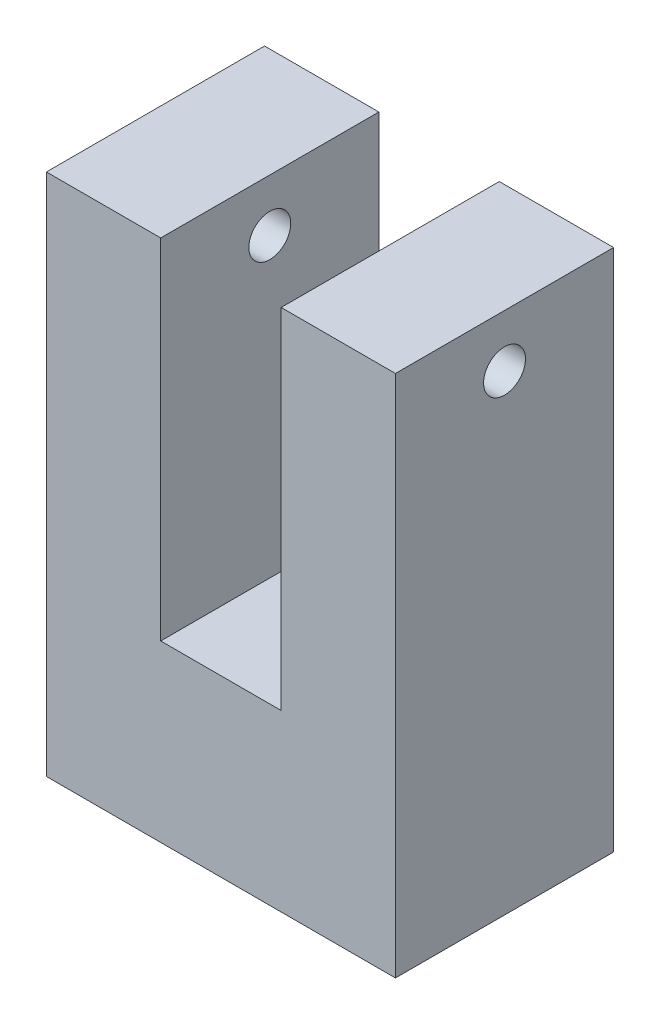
ISO-10303-21;
HEADER;
FILE_DESCRIPTION(('STEP AP214'),'2;1');
FILE_NAME('part.step','',(''),(''),'','','');
FILE_SCHEMA(('AUTOMOTIVE_DESIGN { 1 0 10303 214 1 1 1 1 }'));
ENDSEC;
DATA;
#1=APPLICATION_CONTEXT('core data for automotive mechanical design processes');
#2=APPLICATION_PROTOCOL_DEFINITION('international standard','automotive_design',2000,#1);
#3=PRODUCT_CONTEXT('',#1,'mechanical');
#4=PRODUCT('Part','Part','',(#3));
#5=PRODUCT_RELATED_PRODUCT_CATEGORY('part','',(#4));
#6=PRODUCT_DEFINITION_FORMATION('','',#4);
#7=PRODUCT_DEFINITION_CONTEXT('part definition',#1,'design');
#8=PRODUCT_DEFINITION('design','',#6,#7);
#9=PRODUCT_DEFINITION_SHAPE('','',#8);
#10=(LENGTH_UNIT() NAMED_UNIT(*) SI_UNIT(.MILLI.,.METRE.));
#11=(NAMED_UNIT(*) PLANE_ANGLE_UNIT() SI_UNIT($,.RADIAN.));
#12=(NAMED_UNIT(*) SI_UNIT($,.STERADIAN.) SOLID_ANGLE_UNIT());
#13=UNCERTAINTY_MEASURE_WITH_UNIT(LENGTH_MEASURE(1.E-05),#10,'distance_accuracy_value','');
#14=(GEOMETRIC_REPRESENTATION_CONTEXT(3) GLOBAL_UNCERTAINTY_ASSIGNED_CONTEXT((#13)) GLOBAL_UNIT_ASSIGNED_CONTEXT((#10,
#11,#12)) REPRESENTATION_CONTEXT('',''));
#15=CARTESIAN_POINT('',(0.,0.,0.));
#16=DIRECTION('',(0.,0.,1.));
#17=DIRECTION('',(1.,0.,0.));
#18=AXIS2_PLACEMENT_3D('',#15,#16,#17);
#19=CARTESIAN_POINT('',(0.,38.1,0.));
#20=DIRECTION('',(0.,-1.,0.));
#21=DIRECTION('',(0.,0.,-1.));
#22=AXIS2_PLACEMENT_3D('',#19,#20,#21);
#23=PLANE('',#22);
#24=DIRECTION('',(-1.,0.,0.));
#25=VECTOR('',#24,1.);
#26=CARTESIAN_POINT('',(-12.6999999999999,38.1,-7.93750000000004));
#27=LINE('',#26,#25);
#28=CARTESIAN_POINT('',(12.7000000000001,38.1,-7.93750000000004));
#29=VERTEX_POINT('',#28);
#30=CARTESIAN_POINT('',(4.3815,38.1,-7.93750000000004));
#31=VERTEX_POINT('',#30);
#32=EDGE_CURVE('E87',#29,#31,#27,.T.);
#33=ORIENTED_EDGE('',*,*,#32,.T.);
#34=DIRECTION('',(0.,0.,1.));
#35=VECTOR('',#34,1.);
#36=CARTESIAN_POINT('',(4.3815,38.1,-7.93750000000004));
#37=LINE('',#36,#35);
#38=CARTESIAN_POINT('',(4.3815,38.1,7.93750000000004));
#39=VERTEX_POINT('',#38);
#40=EDGE_CURVE('E109',#31,#39,#37,.T.);
#41=ORIENTED_EDGE('',*,*,#40,.T.);
#42=DIRECTION('',(1.,0.,0.));
#43=VECTOR('',#42,1.);
#44=CARTESIAN_POINT('',(-12.6999999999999,38.1,7.93750000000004));
#45=LINE('',#44,#43);
#46=CARTESIAN_POINT('',(12.7000000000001,38.1,7.93750000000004));
#47=VERTEX_POINT('',#46);
#48=EDGE_CURVE('E58',#39,#47,#45,.T.);
#49=ORIENTED_EDGE('',*,*,#48,.T.);
#50=DIRECTION('',(0.,0.,-1.));
#51=VECTOR('',#50,1.);
#52=CARTESIAN_POINT('',(12.7000000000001,38.1,7.93750000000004));
#53=LINE('',#52,#51);
#54=EDGE_CURVE('E123',#47,#29,#53,.T.);
#55=ORIENTED_EDGE('',*,*,#54,.T.);
#56=EDGE_LOOP('',(#33,#41,#49,#55));
#57=FACE_BOUND('',#56,.T.);
#58=ADVANCED_FACE('F32',(#57),#23,.F.);
#59=CARTESIAN_POINT('',(12.7000000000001,38.1,7.93750000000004));
#60=DIRECTION('',(-1.,0.,0.));
#61=DIRECTION('',(0.,0.,1.));
#62=AXIS2_PLACEMENT_3D('',#59,#60,#61);
#63=PLANE('',#62);
#64=CARTESIAN_POINT('',(12.7000000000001,34.29,0.));
#65=DIRECTION('',(1.,0.,0.));
#66=DIRECTION('',(0.,0.,-1.));
#67=AXIS2_PLACEMENT_3D('',#64,#65,#66);
#68=CIRCLE('',#67,1.524);
#69=CARTESIAN_POINT('',(12.7000000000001,34.29,-1.524));
#70=VERTEX_POINT('',#69);
#71=EDGE_CURVE('E157',#70,#70,#68,.T.);
#72=ORIENTED_EDGE('',*,*,#71,.F.);
#73=EDGE_LOOP('',(#72));
#74=FACE_BOUND('',#73,.T.);
#75=DIRECTION('',(0.,0.,-1.));
#76=VECTOR('',#75,1.);
#77=CARTESIAN_POINT('',(12.7000000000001,0.,7.93750000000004));
#78=LINE('',#77,#76);
#79=CARTESIAN_POINT('',(12.7000000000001,0.,7.93750000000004));
#80=VERTEX_POINT('',#79);
#81=CARTESIAN_POINT('',(12.7000000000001,0.,-7.93750000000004));
#82=VERTEX_POINT('',#81);
#83=EDGE_CURVE('E135',#80,#82,#78,.T.);
#84=ORIENTED_EDGE('',*,*,#83,.T.);
#85=DIRECTION('',(0.,-1.,0.));
#86=VECTOR('',#85,1.);
#87=CARTESIAN_POINT('',(12.7000000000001,38.1,-7.93750000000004));
#88=LINE('',#87,#86);
#89=EDGE_CURVE('E11',#29,#82,#88,.T.);
#90=ORIENTED_EDGE('',*,*,#89,.F.);
#91=ORIENTED_EDGE('',*,*,#54,.F.);
#92=DIRECTION('',(0.,-1.,0.));
#93=VECTOR('',#92,1.);
#94=CARTESIAN_POINT('',(12.7000000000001,38.1,7.93750000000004));
#95=LINE('',#94,#93);
#96=EDGE_CURVE('E134',#47,#80,#95,.T.);
#97=ORIENTED_EDGE('',*,*,#96,.T.);
#98=EDGE_LOOP('',(#84,#90,#91,#97));
#99=FACE_BOUND('',#98,.T.);
#100=ADVANCED_FACE('F34',(#74,#99),#63,.F.);
#101=CARTESIAN_POINT('',(-12.6999999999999,38.1,-7.93750000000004));
#102=DIRECTION('',(0.,0.,1.));
#103=DIRECTION('',(1.,0.,0.));
#104=AXIS2_PLACEMENT_3D('',#101,#102,#103);
#105=PLANE('',#104);
#106=DIRECTION('',(1.,0.,0.));
#107=VECTOR('',#106,1.);
#108=CARTESIAN_POINT('',(-4.3815,12.7,-7.93750000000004));
#109=LINE('',#108,#107);
#110=CARTESIAN_POINT('',(-4.3815,12.7,-7.93750000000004));
#111=VERTEX_POINT('',#110);
#112=CARTESIAN_POINT('',(4.3815,12.7,-7.93750000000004));
#113=VERTEX_POINT('',#112);
#114=EDGE_CURVE('E116',#111,#113,#109,.T.);
#115=ORIENTED_EDGE('',*,*,#114,.T.);
#116=DIRECTION('',(0.,1.,0.));
#117=VECTOR('',#116,1.);
#118=CARTESIAN_POINT('',(4.3815,12.7,-7.93750000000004));
#119=LINE('',#118,#117);
#120=EDGE_CURVE('E111',#113,#31,#119,.T.);
#121=ORIENTED_EDGE('',*,*,#120,.T.);
#122=ORIENTED_EDGE('',*,*,#32,.F.);
#123=ORIENTED_EDGE('',*,*,#89,.T.);
#124=DIRECTION('',(-1.,0.,0.));
#125=VECTOR('',#124,1.);
#126=CARTESIAN_POINT('',(-12.6999999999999,0.,-7.93750000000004));
#127=LINE('',#126,#125);
#128=CARTESIAN_POINT('',(-12.6999999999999,0.,-7.93750000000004));
#129=VERTEX_POINT('',#128);
#130=EDGE_CURVE('E138',#82,#129,#127,.T.);
#131=ORIENTED_EDGE('',*,*,#130,.T.);
#132=DIRECTION('',(0.,-1.,0.));
#133=VECTOR('',#132,1.);
#134=CARTESIAN_POINT('',(-12.6999999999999,38.1,-7.93750000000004));
#135=LINE('',#134,#133);
#136=CARTESIAN_POINT('',(-12.6999999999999,38.1,-7.93750000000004));
#137=VERTEX_POINT('',#136);
#138=EDGE_CURVE('E41',#137,#129,#135,.T.);
#139=ORIENTED_EDGE('',*,*,#138,.F.);
#140=CARTESIAN_POINT('',(-4.3815,38.1,-7.93750000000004));
#141=VERTEX_POINT('',#140);
#142=EDGE_CURVE('E126',#141,#137,#27,.T.);
#143=ORIENTED_EDGE('',*,*,#142,.F.);
#144=DIRECTION('',(0.,-1.,0.));
#145=VECTOR('',#144,1.);
#146=CARTESIAN_POINT('',(-4.3815,12.7,-7.93750000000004));
#147=LINE('',#146,#145);
#148=EDGE_CURVE('E49',#141,#111,#147,.T.);
#149=ORIENTED_EDGE('',*,*,#148,.T.);
#150=EDGE_LOOP('',(#115,#121,#122,#123,#131,#139,#143,#149));
#151=FACE_BOUND('',#150,.T.);
#152=ADVANCED_FACE('F118',(#151),#105,.F.);
#153=CARTESIAN_POINT('',(-12.6999999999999,38.1,7.93750000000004));
#154=DIRECTION('',(1.,0.,0.));
#155=DIRECTION('',(0.,0.,-1.));
#156=AXIS2_PLACEMENT_3D('',#153,#154,#155);
#157=PLANE('',#156);
#158=CARTESIAN_POINT('',(-12.6999999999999,34.29,0.));
#159=DIRECTION('',(1.,0.,0.));
#160=DIRECTION('',(0.,0.,-1.));
#161=AXIS2_PLACEMENT_3D('',#158,#159,#160);
#162=CIRCLE('',#161,1.524);
#163=CARTESIAN_POINT('',(-12.6999999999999,34.29,-1.524));
#164=VERTEX_POINT('',#163);
#165=EDGE_CURVE('E151',#164,#164,#162,.T.);
#166=ORIENTED_EDGE('',*,*,#165,.T.);
#167=EDGE_LOOP('',(#166));
#168=FACE_BOUND('',#167,.T.);
#169=DIRECTION('',(0.,0.,1.));
#170=VECTOR('',#169,1.);
#171=CARTESIAN_POINT('',(-12.6999999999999,0.,7.93750000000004));
#172=LINE('',#171,#170);
#173=CARTESIAN_POINT('',(-12.6999999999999,0.,7.93750000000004));
#174=VERTEX_POINT('',#173);
#175=EDGE_CURVE('E141',#129,#174,#172,.T.);
#176=ORIENTED_EDGE('',*,*,#175,.T.);
#177=DIRECTION('',(0.,-1.,0.));
#178=VECTOR('',#177,1.);
#179=CARTESIAN_POINT('',(-12.6999999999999,38.1,7.93750000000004));
#180=LINE('',#179,#178);
#181=CARTESIAN_POINT('',(-12.6999999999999,38.1,7.93750000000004));
#182=VERTEX_POINT('',#181);
#183=EDGE_CURVE('E145',#182,#174,#180,.T.);
#184=ORIENTED_EDGE('',*,*,#183,.F.);
#185=DIRECTION('',(0.,0.,1.));
#186=VECTOR('',#185,1.);
#187=CARTESIAN_POINT('',(-12.6999999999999,38.1,7.93750000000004));
#188=LINE('',#187,#186);
#189=EDGE_CURVE('E125',#137,#182,#188,.T.);
#190=ORIENTED_EDGE('',*,*,#189,.F.);
#191=ORIENTED_EDGE('',*,*,#138,.T.);
#192=EDGE_LOOP('',(#176,#184,#190,#191));
#193=FACE_BOUND('',#192,.T.);
#194=ADVANCED_FACE('F189',(#168,#193),#157,.F.);
#195=CARTESIAN_POINT('',(-12.6999999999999,38.1,7.93750000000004));
#196=DIRECTION('',(0.,0.,-1.));
#197=DIRECTION('',(-1.,0.,0.));
#198=AXIS2_PLACEMENT_3D('',#195,#196,#197);
#199=PLANE('',#198);
#200=ORIENTED_EDGE('',*,*,#48,.F.);
#201=DIRECTION('',(0.,1.,0.));
#202=VECTOR('',#201,1.);
#203=CARTESIAN_POINT('',(4.3815,12.7,7.93750000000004));
#204=LINE('',#203,#202);
#205=CARTESIAN_POINT('',(4.3815,12.7,7.93750000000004));
#206=VERTEX_POINT('',#205);
#207=EDGE_CURVE('E114',#206,#39,#204,.T.);
#208=ORIENTED_EDGE('',*,*,#207,.F.);
#209=DIRECTION('',(1.,0.,0.));
#210=VECTOR('',#209,1.);
#211=CARTESIAN_POINT('',(-4.3815,12.7,7.93750000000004));
#212=LINE('',#211,#210);
#213=CARTESIAN_POINT('',(-4.3815,12.7,7.93750000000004));
#214=VERTEX_POINT('',#213);
#215=EDGE_CURVE('E120',#214,#206,#212,.T.);
#216=ORIENTED_EDGE('',*,*,#215,.F.);
#217=DIRECTION('',(0.,-1.,0.));
#218=VECTOR('',#217,1.);
#219=CARTESIAN_POINT('',(-4.3815,12.7,7.93750000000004));
#220=LINE('',#219,#218);
#221=CARTESIAN_POINT('',(-4.3815,38.1,7.93750000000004));
#222=VERTEX_POINT('',#221);
#223=EDGE_CURVE('E169',#222,#214,#220,.T.);
#224=ORIENTED_EDGE('',*,*,#223,.F.);
#225=EDGE_CURVE('E131',#182,#222,#45,.T.);
#226=ORIENTED_EDGE('',*,*,#225,.F.);
#227=ORIENTED_EDGE('',*,*,#183,.T.);
#228=DIRECTION('',(1.,0.,0.));
#229=VECTOR('',#228,1.);
#230=CARTESIAN_POINT('',(-12.6999999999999,0.,7.93750000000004));
#231=LINE('',#230,#229);
#232=EDGE_CURVE('E80',#174,#80,#231,.T.);
#233=ORIENTED_EDGE('',*,*,#232,.T.);
#234=ORIENTED_EDGE('',*,*,#96,.F.);
#235=EDGE_LOOP('',(#200,#208,#216,#224,#226,#227,#233,#234));
#236=FACE_BOUND('',#235,.T.);
#237=ADVANCED_FACE('F183',(#236),#199,.F.);
#238=ORIENTED_EDGE('',*,*,#225,.T.);
#239=DIRECTION('',(0.,0.,1.));
#240=VECTOR('',#239,1.);
#241=CARTESIAN_POINT('',(-4.3815,38.1,-7.93750000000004));
#242=LINE('',#241,#240);
#243=EDGE_CURVE('E115',#141,#222,#242,.T.);
#244=ORIENTED_EDGE('',*,*,#243,.F.);
#245=ORIENTED_EDGE('',*,*,#142,.T.);
#246=ORIENTED_EDGE('',*,*,#189,.T.);
#247=EDGE_LOOP('',(#238,#244,#245,#246));
#248=FACE_BOUND('',#247,.T.);
#249=ADVANCED_FACE('F184',(#248),#23,.F.);
#250=CARTESIAN_POINT('',(0.,0.,0.));
#251=DIRECTION('',(0.,-1.,0.));
#252=DIRECTION('',(0.,0.,-1.));
#253=AXIS2_PLACEMENT_3D('',#250,#251,#252);
#254=PLANE('',#253);
#255=CARTESIAN_POINT('',(0.,0.,0.));
#256=DIRECTION('',(0.,-1.,0.));
#257=DIRECTION('',(0.,0.,-1.));
#258=AXIS2_PLACEMENT_3D('',#255,#256,#257);
#259=CIRCLE('',#258,2.0955);
#260=CARTESIAN_POINT('',(0.,0.,-2.0955));
#261=VERTEX_POINT('',#260);
#262=EDGE_CURVE('E164',#261,#261,#259,.T.);
#263=ORIENTED_EDGE('',*,*,#262,.F.);
#264=EDGE_LOOP('',(#263));
#265=FACE_BOUND('',#264,.T.);
#266=ORIENTED_EDGE('',*,*,#83,.F.);
#267=ORIENTED_EDGE('',*,*,#232,.F.);
#268=ORIENTED_EDGE('',*,*,#175,.F.);
#269=ORIENTED_EDGE('',*,*,#130,.F.);
#270=EDGE_LOOP('',(#266,#267,#268,#269));
#271=FACE_BOUND('',#270,.T.);
#272=ADVANCED_FACE('F193',(#265,#271),#254,.T.);
#273=CARTESIAN_POINT('',(4.3815,12.7,-7.93750000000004));
#274=DIRECTION('',(1.,0.,0.));
#275=DIRECTION('',(0.,0.,-1.));
#276=AXIS2_PLACEMENT_3D('',#273,#274,#275);
#277=PLANE('',#276);
#278=CARTESIAN_POINT('',(4.3815,34.29,0.));
#279=DIRECTION('',(1.,0.,0.));
#280=DIRECTION('',(0.,0.,-1.));
#281=AXIS2_PLACEMENT_3D('',#278,#279,#280);
#282=CIRCLE('',#281,1.524);
#283=CARTESIAN_POINT('',(4.3815,34.29,-1.524));
#284=VERTEX_POINT('',#283);
#285=EDGE_CURVE('E150',#284,#284,#282,.T.);
#286=ORIENTED_EDGE('',*,*,#285,.T.);
#287=EDGE_LOOP('',(#286));
#288=FACE_BOUND('',#287,.T.);
#289=ORIENTED_EDGE('',*,*,#207,.T.);
#290=ORIENTED_EDGE('',*,*,#40,.F.);
#291=ORIENTED_EDGE('',*,*,#120,.F.);
#292=DIRECTION('',(0.,0.,1.));
#293=VECTOR('',#292,1.);
#294=CARTESIAN_POINT('',(4.3815,12.7,-7.93750000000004));
#295=LINE('',#294,#293);
#296=EDGE_CURVE('E139',#113,#206,#295,.T.);
#297=ORIENTED_EDGE('',*,*,#296,.T.);
#298=EDGE_LOOP('',(#289,#290,#291,#297));
#299=FACE_BOUND('',#298,.T.);
#300=ADVANCED_FACE('F110',(#288,#299),#277,.F.);
#301=CARTESIAN_POINT('',(-4.3815,12.7,-7.93750000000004));
#302=DIRECTION('',(0.,-1.,0.));
#303=DIRECTION('',(0.,0.,-1.));
#304=AXIS2_PLACEMENT_3D('',#301,#302,#303);
#305=PLANE('',#304);
#306=CARTESIAN_POINT('',(0.,12.7,0.));
#307=DIRECTION('',(0.,-1.,0.));
#308=DIRECTION('',(0.,0.,-1.));
#309=AXIS2_PLACEMENT_3D('',#306,#307,#308);
#310=CIRCLE('',#309,2.0955);
#311=CARTESIAN_POINT('',(0.,12.7,-2.0955));
#312=VERTEX_POINT('',#311);
#313=EDGE_CURVE('E36',#312,#312,#310,.T.);
#314=ORIENTED_EDGE('',*,*,#313,.T.);
#315=EDGE_LOOP('',(#314));
#316=FACE_BOUND('',#315,.T.);
#317=ORIENTED_EDGE('',*,*,#215,.T.);
#318=ORIENTED_EDGE('',*,*,#296,.F.);
#319=ORIENTED_EDGE('',*,*,#114,.F.);
#320=DIRECTION('',(0.,0.,1.));
#321=VECTOR('',#320,1.);
#322=CARTESIAN_POINT('',(-4.3815,12.7,-7.93750000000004));
#323=LINE('',#322,#321);
#324=EDGE_CURVE('E175',#111,#214,#323,.T.);
#325=ORIENTED_EDGE('',*,*,#324,.T.);
#326=EDGE_LOOP('',(#317,#318,#319,#325));
#327=FACE_BOUND('',#326,.T.);
#328=ADVANCED_FACE('F213',(#316,#327),#305,.F.);
#329=CARTESIAN_POINT('',(-4.3815,12.7,-7.93750000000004));
#330=DIRECTION('',(-1.,0.,0.));
#331=DIRECTION('',(0.,0.,1.));
#332=AXIS2_PLACEMENT_3D('',#329,#330,#331);
#333=PLANE('',#332);
#334=CARTESIAN_POINT('',(-4.3815,34.29,0.));
#335=DIRECTION('',(-1.,0.,0.));
#336=DIRECTION('',(0.,0.,1.));
#337=AXIS2_PLACEMENT_3D('',#334,#335,#336);
#338=CIRCLE('',#337,1.524);
#339=CARTESIAN_POINT('',(-4.3815,34.29,1.524));
#340=VERTEX_POINT('',#339);
#341=EDGE_CURVE('E148',#340,#340,#338,.T.);
#342=ORIENTED_EDGE('',*,*,#341,.T.);
#343=EDGE_LOOP('',(#342));
#344=FACE_BOUND('',#343,.T.);
#345=ORIENTED_EDGE('',*,*,#223,.T.);
#346=ORIENTED_EDGE('',*,*,#324,.F.);
#347=ORIENTED_EDGE('',*,*,#148,.F.);
#348=ORIENTED_EDGE('',*,*,#243,.T.);
#349=EDGE_LOOP('',(#345,#346,#347,#348));
#350=FACE_BOUND('',#349,.T.);
#351=ADVANCED_FACE('F178',(#344,#350),#333,.F.);
#352=CARTESIAN_POINT('',(-12.6999999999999,34.29,0.));
#353=DIRECTION('',(1.,0.,0.));
#354=DIRECTION('',(0.,0.,-1.));
#355=AXIS2_PLACEMENT_3D('',#352,#353,#354);
#356=CYLINDRICAL_SURFACE('',#355,1.524);
#357=ORIENTED_EDGE('',*,*,#165,.F.);
#358=EDGE_LOOP('',(#357));
#359=FACE_BOUND('',#358,.T.);
#360=ORIENTED_EDGE('',*,*,#341,.F.);
#361=EDGE_LOOP('',(#360));
#362=FACE_BOUND('',#361,.T.);
#363=ADVANCED_FACE('F208',(#359,#362),#356,.F.);
#364=ORIENTED_EDGE('',*,*,#71,.T.);
#365=EDGE_LOOP('',(#364));
#366=FACE_BOUND('',#365,.T.);
#367=ORIENTED_EDGE('',*,*,#285,.F.);
#368=EDGE_LOOP('',(#367));
#369=FACE_BOUND('',#368,.T.);
#370=ADVANCED_FACE('F204',(#366,#369),#356,.F.);
#371=CARTESIAN_POINT('',(0.,38.1,0.));
#372=DIRECTION('',(0.,-1.,0.));
#373=DIRECTION('',(0.,0.,-1.));
#374=AXIS2_PLACEMENT_3D('',#371,#372,#373);
#375=CYLINDRICAL_SURFACE('',#374,2.0955);
#376=CARTESIAN_POINT('',(0.,0.,-2.0955));
#377=CARTESIAN_POINT('',(0.,0.132291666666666,-2.0955));
#378=CARTESIAN_POINT('',(0.,0.264583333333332,-2.0955));
#379=CARTESIAN_POINT('',(0.,0.529166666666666,-2.0955));
#380=CARTESIAN_POINT('',(0.,0.661458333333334,-2.0955));
#381=CARTESIAN_POINT('',(0.,0.926041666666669,-2.0955));
#382=CARTESIAN_POINT('',(0.,1.05833333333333,-2.0955));
#383=CARTESIAN_POINT('',(0.,1.32291666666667,-2.0955));
#384=CARTESIAN_POINT('',(0.,1.45520833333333,-2.0955));
#385=CARTESIAN_POINT('',(0.,1.71979166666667,-2.0955));
#386=CARTESIAN_POINT('',(0.,1.85208333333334,-2.0955));
#387=CARTESIAN_POINT('',(0.,2.11666666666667,-2.0955));
#388=CARTESIAN_POINT('',(0.,2.24895833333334,-2.0955));
#389=CARTESIAN_POINT('',(0.,2.51354166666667,-2.0955));
#390=CARTESIAN_POINT('',(0.,2.64583333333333,-2.0955));
#391=CARTESIAN_POINT('',(0.,2.91041666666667,-2.0955));
#392=CARTESIAN_POINT('',(0.,3.04270833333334,-2.0955));
#393=CARTESIAN_POINT('',(0.,3.30729166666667,-2.0955));
#394=CARTESIAN_POINT('',(0.,3.43958333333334,-2.0955));
#395=CARTESIAN_POINT('',(0.,3.70416666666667,-2.0955));
#396=CARTESIAN_POINT('',(0.,3.83645833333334,-2.0955));
#397=CARTESIAN_POINT('',(0.,4.10104166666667,-2.0955));
#398=CARTESIAN_POINT('',(0.,4.23333333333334,-2.0955));
#399=CARTESIAN_POINT('',(0.,4.49791666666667,-2.0955));
#400=CARTESIAN_POINT('',(0.,4.63020833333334,-2.0955));
#401=CARTESIAN_POINT('',(0.,4.89479166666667,-2.0955));
#402=CARTESIAN_POINT('',(0.,5.02708333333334,-2.0955));
#403=CARTESIAN_POINT('',(0.,5.29166666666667,-2.0955));
#404=CARTESIAN_POINT('',(0.,5.42395833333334,-2.0955));
#405=CARTESIAN_POINT('',(0.,5.68854166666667,-2.0955));
#406=CARTESIAN_POINT('',(0.,5.82083333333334,-2.0955));
#407=CARTESIAN_POINT('',(0.,6.08541666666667,-2.0955));
#408=CARTESIAN_POINT('',(0.,6.21770833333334,-2.0955));
#409=CARTESIAN_POINT('',(0.,6.48229166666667,-2.0955));
#410=CARTESIAN_POINT('',(0.,6.61458333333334,-2.0955));
#411=CARTESIAN_POINT('',(0.,6.87916666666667,-2.0955));
#412=CARTESIAN_POINT('',(0.,7.01145833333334,-2.0955));
#413=CARTESIAN_POINT('',(0.,7.27604166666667,-2.0955));
#414=CARTESIAN_POINT('',(0.,7.40833333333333,-2.0955));
#415=CARTESIAN_POINT('',(0.,7.67291666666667,-2.0955));
#416=CARTESIAN_POINT('',(0.,7.80520833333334,-2.0955));
#417=CARTESIAN_POINT('',(0.,8.06979166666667,-2.0955));
#418=CARTESIAN_POINT('',(0.,8.20208333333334,-2.0955));
#419=CARTESIAN_POINT('',(0.,8.46666666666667,-2.0955));
#420=CARTESIAN_POINT('',(0.,8.59895833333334,-2.0955));
#421=CARTESIAN_POINT('',(0.,8.86354166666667,-2.0955));
#422=CARTESIAN_POINT('',(0.,8.99583333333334,-2.0955));
#423=CARTESIAN_POINT('',(0.,9.26041666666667,-2.0955));
#424=CARTESIAN_POINT('',(0.,9.39270833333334,-2.0955));
#425=CARTESIAN_POINT('',(0.,9.65729166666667,-2.0955));
#426=CARTESIAN_POINT('',(0.,9.78958333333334,-2.0955));
#427=CARTESIAN_POINT('',(0.,10.0541666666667,-2.0955));
#428=CARTESIAN_POINT('',(0.,10.1864583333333,-2.0955));
#429=CARTESIAN_POINT('',(0.,10.4510416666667,-2.0955));
#430=CARTESIAN_POINT('',(0.,10.5833333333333,-2.0955));
#431=CARTESIAN_POINT('',(0.,10.8479166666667,-2.0955));
#432=CARTESIAN_POINT('',(0.,10.9802083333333,-2.0955));
#433=CARTESIAN_POINT('',(0.,11.2447916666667,-2.0955));
#434=CARTESIAN_POINT('',(0.,11.3770833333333,-2.0955));
#435=CARTESIAN_POINT('',(0.,11.6416666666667,-2.0955));
#436=CARTESIAN_POINT('',(0.,11.7739583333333,-2.0955));
#437=CARTESIAN_POINT('',(0.,12.0385416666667,-2.0955));
#438=CARTESIAN_POINT('',(0.,12.1708333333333,-2.0955));
#439=CARTESIAN_POINT('',(0.,12.4354166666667,-2.0955));
#440=CARTESIAN_POINT('',(0.,12.5677083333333,-2.0955));
#441=CARTESIAN_POINT('',(0.,12.7,-2.0955));
#442=B_SPLINE_CURVE_WITH_KNOTS('',3,(#376,#377,#378,#379,#380,#381,#382,#383,#384,#385,#386,
#387,#388,#389,#390,#391,#392,#393,#394,#395,#396,#397,#398,#399,#400,#401,#402,#403,#404,#405,
#406,#407,#408,#409,#410,#411,#412,#413,#414,#415,#416,#417,#418,#419,#420,#421,#422,#423,#424,
#425,#426,#427,#428,#429,#430,#431,#432,#433,#434,#435,#436,#437,#438,#439,#440,#441),
.UNSPECIFIED.,.F.,.F.,(4,2,2,2,2,2,2,2,2,2,2,2,2,2,2,2,2,2,2,2,2,2,2,2,2,2,2,2,2,2,2,2,4),(0.,
0.396874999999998,0.793750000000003,1.190625,1.5875,1.984375,2.38125,2.778125,3.175,3.571875,
3.96875000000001,4.365625,4.7625,5.15937500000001,5.55625000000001,5.953125,6.35000000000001,
6.74687500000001,7.14375,7.540625,7.9375,8.334375,8.73125,9.128125,9.525,9.921875,10.31875,
10.715625,11.1125,11.509375,11.90625,12.303125,12.7),.UNSPECIFIED.);
#443=EDGE_CURVE('BSEAM207',#261,#312,#442,.T.);
#444=ORIENTED_EDGE('',*,*,#262,.T.);
#445=ORIENTED_EDGE('',*,*,#313,.F.);
#446=ORIENTED_EDGE('',*,*,#443,.T.);
#447=ORIENTED_EDGE('',*,*,#443,.F.);
#448=EDGE_LOOP('',(#444,#446,#445,#447));
#449=FACE_BOUND('',#448,.T.);
#450=ADVANCED_FACE('F207',(#449),#375,.F.);
#451=CLOSED_SHELL('',(#58,#100,#152,#194,#237,#249,#272,#300,#328,#351,#363,#370,#450));
#452=MANIFOLD_SOLID_BREP('B2',#451);
#453=ADVANCED_BREP_SHAPE_REPRESENTATION('',(#18,#452),#14);
#454=SHAPE_DEFINITION_REPRESENTATION(#9,#453);
ENDSEC;
END-ISO-10303-21;
